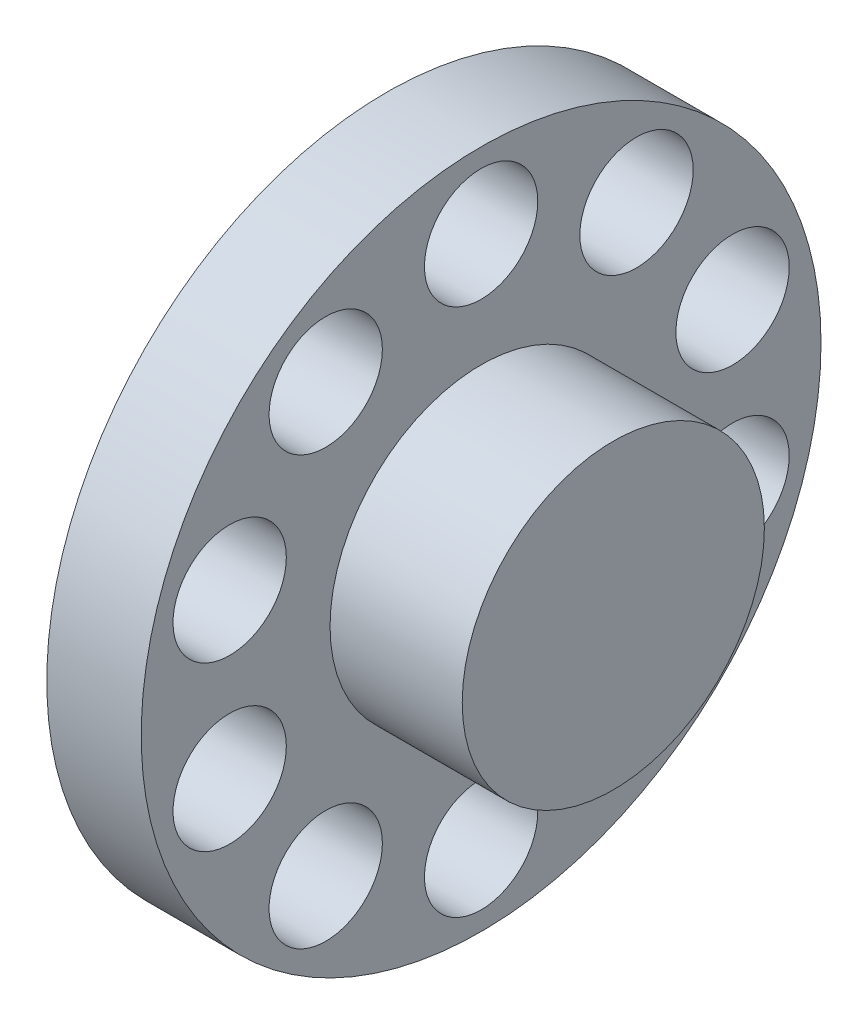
ISO-10303-21;
HEADER;
FILE_DESCRIPTION(('STEP AP214'),'2;1');
FILE_NAME('part.step','',(''),(''),'','','');
FILE_SCHEMA(('AUTOMOTIVE_DESIGN { 1 0 10303 214 1 1 1 1 }'));
ENDSEC;
DATA;
#1=APPLICATION_CONTEXT('core data for automotive mechanical design processes');
#2=APPLICATION_PROTOCOL_DEFINITION('international standard','automotive_design',2000,#1);
#3=PRODUCT_CONTEXT('',#1,'mechanical');
#4=PRODUCT('Part','Part','',(#3));
#5=PRODUCT_RELATED_PRODUCT_CATEGORY('part','',(#4));
#6=PRODUCT_DEFINITION_FORMATION('','',#4);
#7=PRODUCT_DEFINITION_CONTEXT('part definition',#1,'design');
#8=PRODUCT_DEFINITION('design','',#6,#7);
#9=PRODUCT_DEFINITION_SHAPE('','',#8);
#10=(LENGTH_UNIT() NAMED_UNIT(*) SI_UNIT(.MILLI.,.METRE.));
#11=(NAMED_UNIT(*) PLANE_ANGLE_UNIT() SI_UNIT($,.RADIAN.));
#12=(NAMED_UNIT(*) SI_UNIT($,.STERADIAN.) SOLID_ANGLE_UNIT());
#13=UNCERTAINTY_MEASURE_WITH_UNIT(LENGTH_MEASURE(1.E-05),#10,'distance_accuracy_value','');
#14=(GEOMETRIC_REPRESENTATION_CONTEXT(3) GLOBAL_UNCERTAINTY_ASSIGNED_CONTEXT((#13)) GLOBAL_UNIT_ASSIGNED_CONTEXT((#10,
#11,#12)) REPRESENTATION_CONTEXT('',''));
#15=CARTESIAN_POINT('',(0.,0.,0.));
#16=DIRECTION('',(0.,0.,1.));
#17=DIRECTION('',(1.,0.,0.));
#18=AXIS2_PLACEMENT_3D('',#15,#16,#17);
#19=CARTESIAN_POINT('',(0.,0.,0.));
#20=DIRECTION('',(-1.,0.,0.));
#21=DIRECTION('',(0.,0.,1.));
#22=AXIS2_PLACEMENT_3D('',#19,#20,#21);
#23=PLANE('',#22);
#24=CARTESIAN_POINT('',(0.,56.6311896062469,-41.1449676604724));
#25=DIRECTION('',(-1.,0.,0.));
#26=DIRECTION('',(0.,0.587785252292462,0.809016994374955));
#27=AXIS2_PLACEMENT_3D('',#24,#25,#26);
#28=CIRCLE('',#27,15.);
#29=CARTESIAN_POINT('',(0.,65.4479683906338,-29.0097127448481));
#30=VERTEX_POINT('',#29);
#31=EDGE_CURVE('E112',#30,#30,#28,.T.);
#32=ORIENTED_EDGE('',*,*,#31,.F.);
#33=EDGE_LOOP('',(#32));
#34=FACE_BOUND('',#33,.T.);
#35=CARTESIAN_POINT('',(0.,21.6311896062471,-66.5739561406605));
#36=DIRECTION('',(-1.,0.,0.));
#37=DIRECTION('',(0.,0.95105651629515,0.309016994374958));
#38=AXIS2_PLACEMENT_3D('',#35,#36,#37);
#39=CIRCLE('',#38,15.);
#40=CARTESIAN_POINT('',(0.,35.8970373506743,-61.9387012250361));
#41=VERTEX_POINT('',#40);
#42=EDGE_CURVE('E116',#41,#41,#39,.T.);
#43=ORIENTED_EDGE('',*,*,#42,.F.);
#44=EDGE_LOOP('',(#43));
#45=FACE_BOUND('',#44,.T.);
#46=CARTESIAN_POINT('',(0.,-21.6311896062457,-66.573956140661));
#47=DIRECTION('',(-1.,0.,0.));
#48=DIRECTION('',(0.,0.951056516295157,-0.309016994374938));
#49=AXIS2_PLACEMENT_3D('',#46,#47,#48);
#50=CIRCLE('',#49,15.);
#51=CARTESIAN_POINT('',(0.,-7.36534186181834,-71.209211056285));
#52=VERTEX_POINT('',#51);
#53=EDGE_CURVE('E120',#52,#52,#50,.T.);
#54=ORIENTED_EDGE('',*,*,#53,.F.);
#55=EDGE_LOOP('',(#54));
#56=FACE_BOUND('',#55,.T.);
#57=CARTESIAN_POINT('',(0.,-56.631189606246,-41.1449676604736));
#58=DIRECTION('',(-1.,0.,0.));
#59=DIRECTION('',(0.,0.58778525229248,-0.809016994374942));
#60=AXIS2_PLACEMENT_3D('',#57,#58,#59);
#61=CIRCLE('',#60,15.);
#62=CARTESIAN_POINT('',(0.,-47.8144108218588,-53.2802225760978));
#63=VERTEX_POINT('',#62);
#64=EDGE_CURVE('E124',#63,#63,#61,.T.);
#65=ORIENTED_EDGE('',*,*,#64,.F.);
#66=EDGE_LOOP('',(#65));
#67=FACE_BOUND('',#66,.T.);
#68=CARTESIAN_POINT('',(0.,-70.,0.));
#69=DIRECTION('',(-1.,0.,0.));
#70=DIRECTION('',(0.,0.,-1.));
#71=AXIS2_PLACEMENT_3D('',#68,#69,#70);
#72=CIRCLE('',#71,15.);
#73=CARTESIAN_POINT('',(0.,-70.,-15.));
#74=VERTEX_POINT('',#73);
#75=EDGE_CURVE('E128',#74,#74,#72,.T.);
#76=ORIENTED_EDGE('',*,*,#75,.F.);
#77=EDGE_LOOP('',(#76));
#78=FACE_BOUND('',#77,.T.);
#79=CARTESIAN_POINT('',(0.,-56.6311896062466,41.1449676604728));
#80=DIRECTION('',(-1.,0.,0.));
#81=DIRECTION('',(0.,-0.587785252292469,-0.809016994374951));
#82=AXIS2_PLACEMENT_3D('',#79,#80,#81);
#83=CIRCLE('',#82,15.);
#84=CARTESIAN_POINT('',(0.,-65.4479683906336,29.0097127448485));
#85=VERTEX_POINT('',#84);
#86=EDGE_CURVE('E132',#85,#85,#83,.T.);
#87=ORIENTED_EDGE('',*,*,#86,.F.);
#88=EDGE_LOOP('',(#87));
#89=FACE_BOUND('',#88,.T.);
#90=CARTESIAN_POINT('',(0.,-21.6311896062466,66.5739561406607));
#91=DIRECTION('',(-1.,0.,0.));
#92=DIRECTION('',(0.,-0.951056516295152,-0.309016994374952));
#93=AXIS2_PLACEMENT_3D('',#90,#91,#92);
#94=CIRCLE('',#93,15.);
#95=CARTESIAN_POINT('',(0.,-35.8970373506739,61.9387012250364));
#96=VERTEX_POINT('',#95);
#97=EDGE_CURVE('E136',#96,#96,#94,.T.);
#98=ORIENTED_EDGE('',*,*,#97,.F.);
#99=EDGE_LOOP('',(#98));
#100=FACE_BOUND('',#99,.T.);
#101=CARTESIAN_POINT('',(0.,21.6311896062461,66.5739561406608));
#102=DIRECTION('',(-1.,0.,0.));
#103=DIRECTION('',(0.,-0.951056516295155,0.309016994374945));
#104=AXIS2_PLACEMENT_3D('',#101,#102,#103);
#105=CIRCLE('',#104,15.);
#106=CARTESIAN_POINT('',(0.,7.36534186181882,71.209211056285));
#107=VERTEX_POINT('',#106);
#108=EDGE_CURVE('E140',#107,#107,#105,.T.);
#109=ORIENTED_EDGE('',*,*,#108,.F.);
#110=EDGE_LOOP('',(#109));
#111=FACE_BOUND('',#110,.T.);
#112=CARTESIAN_POINT('',(0.,56.6311896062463,41.1449676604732));
#113=DIRECTION('',(-1.,0.,0.));
#114=DIRECTION('',(0.,-0.587785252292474,0.809016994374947));
#115=AXIS2_PLACEMENT_3D('',#112,#113,#114);
#116=CIRCLE('',#115,15.);
#117=CARTESIAN_POINT('',(0.,47.8144108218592,53.2802225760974));
#118=VERTEX_POINT('',#117);
#119=EDGE_CURVE('E55',#118,#118,#116,.T.);
#120=ORIENTED_EDGE('',*,*,#119,.F.);
#121=EDGE_LOOP('',(#120));
#122=FACE_BOUND('',#121,.T.);
#123=CARTESIAN_POINT('',(0.,70.,0.));
#124=DIRECTION('',(-1.,0.,0.));
#125=DIRECTION('',(0.,0.,1.));
#126=AXIS2_PLACEMENT_3D('',#123,#124,#125);
#127=CIRCLE('',#126,15.);
#128=CARTESIAN_POINT('',(0.,70.,15.));
#129=VERTEX_POINT('',#128);
#130=EDGE_CURVE('E50',#129,#129,#127,.T.);
#131=ORIENTED_EDGE('',*,*,#130,.F.);
#132=EDGE_LOOP('',(#131));
#133=FACE_BOUND('',#132,.T.);
#134=CARTESIAN_POINT('',(0.,0.,0.));
#135=DIRECTION('',(1.,0.,0.));
#136=DIRECTION('',(0.,0.,-1.));
#137=AXIS2_PLACEMENT_3D('',#134,#135,#136);
#138=CIRCLE('',#137,90.);
#139=CARTESIAN_POINT('',(0.,0.,-90.));
#140=VERTEX_POINT('',#139);
#141=EDGE_CURVE('E10',#140,#140,#138,.T.);
#142=ORIENTED_EDGE('',*,*,#141,.F.);
#143=EDGE_LOOP('',(#142));
#144=FACE_BOUND('',#143,.T.);
#145=ADVANCED_FACE('F30',(#34,#45,#56,#67,#78,#89,#100,#111,#122,#133,#144),#23,.T.);
#146=CARTESIAN_POINT('',(0.,0.,0.));
#147=DIRECTION('',(1.,0.,0.));
#148=DIRECTION('',(0.,0.,-1.));
#149=AXIS2_PLACEMENT_3D('',#146,#147,#148);
#150=CYLINDRICAL_SURFACE('',#149,90.);
#151=ORIENTED_EDGE('',*,*,#141,.T.);
#152=EDGE_LOOP('',(#151));
#153=FACE_BOUND('',#152,.T.);
#154=CARTESIAN_POINT('',(25.,0.,0.));
#155=DIRECTION('',(1.,0.,0.));
#156=DIRECTION('',(0.,0.,-1.));
#157=AXIS2_PLACEMENT_3D('',#154,#155,#156);
#158=CIRCLE('',#157,90.);
#159=CARTESIAN_POINT('',(25.,0.,-90.));
#160=VERTEX_POINT('',#159);
#161=EDGE_CURVE('E37',#160,#160,#158,.T.);
#162=ORIENTED_EDGE('',*,*,#161,.F.);
#163=EDGE_LOOP('',(#162));
#164=FACE_BOUND('',#163,.T.);
#165=ADVANCED_FACE('F95',(#153,#164),#150,.T.);
#166=CARTESIAN_POINT('',(25.,90.,0.));
#167=DIRECTION('',(1.,0.,0.));
#168=DIRECTION('',(0.,0.,-1.));
#169=AXIS2_PLACEMENT_3D('',#166,#167,#168);
#170=PLANE('',#169);
#171=CARTESIAN_POINT('',(25.,56.6311896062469,-41.1449676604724));
#172=DIRECTION('',(1.,0.,0.));
#173=DIRECTION('',(0.,0.,-1.));
#174=AXIS2_PLACEMENT_3D('',#171,#172,#173);
#175=CIRCLE('',#174,15.);
#176=CARTESIAN_POINT('',(25.,56.6311896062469,-56.1449676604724));
#177=VERTEX_POINT('',#176);
#178=EDGE_CURVE('E33',#177,#177,#175,.T.);
#179=ORIENTED_EDGE('',*,*,#178,.F.);
#180=EDGE_LOOP('',(#179));
#181=FACE_BOUND('',#180,.T.);
#182=CARTESIAN_POINT('',(25.,21.6311896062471,-66.5739561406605));
#183=DIRECTION('',(1.,0.,0.));
#184=DIRECTION('',(0.,0.,-1.));
#185=AXIS2_PLACEMENT_3D('',#182,#183,#184);
#186=CIRCLE('',#185,15.);
#187=CARTESIAN_POINT('',(25.,21.6311896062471,-81.5739561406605));
#188=VERTEX_POINT('',#187);
#189=EDGE_CURVE('E72',#188,#188,#186,.T.);
#190=ORIENTED_EDGE('',*,*,#189,.F.);
#191=EDGE_LOOP('',(#190));
#192=FACE_BOUND('',#191,.T.);
#193=CARTESIAN_POINT('',(25.,-21.6311896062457,-66.573956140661));
#194=DIRECTION('',(1.,0.,0.));
#195=DIRECTION('',(0.,0.,-1.));
#196=AXIS2_PLACEMENT_3D('',#193,#194,#195);
#197=CIRCLE('',#196,15.);
#198=CARTESIAN_POINT('',(25.,-21.6311896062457,-81.573956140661));
#199=VERTEX_POINT('',#198);
#200=EDGE_CURVE('E70',#199,#199,#197,.T.);
#201=ORIENTED_EDGE('',*,*,#200,.F.);
#202=EDGE_LOOP('',(#201));
#203=FACE_BOUND('',#202,.T.);
#204=CARTESIAN_POINT('',(25.,-56.631189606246,-41.1449676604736));
#205=DIRECTION('',(1.,0.,0.));
#206=DIRECTION('',(0.,0.,-1.));
#207=AXIS2_PLACEMENT_3D('',#204,#205,#206);
#208=CIRCLE('',#207,15.);
#209=CARTESIAN_POINT('',(25.,-56.631189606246,-56.1449676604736));
#210=VERTEX_POINT('',#209);
#211=EDGE_CURVE('E67',#210,#210,#208,.T.);
#212=ORIENTED_EDGE('',*,*,#211,.F.);
#213=EDGE_LOOP('',(#212));
#214=FACE_BOUND('',#213,.T.);
#215=CARTESIAN_POINT('',(25.,-70.,0.));
#216=DIRECTION('',(1.,0.,0.));
#217=DIRECTION('',(0.,0.,-1.));
#218=AXIS2_PLACEMENT_3D('',#215,#216,#217);
#219=CIRCLE('',#218,15.);
#220=CARTESIAN_POINT('',(25.,-70.,-15.));
#221=VERTEX_POINT('',#220);
#222=EDGE_CURVE('E64',#221,#221,#219,.T.);
#223=ORIENTED_EDGE('',*,*,#222,.F.);
#224=EDGE_LOOP('',(#223));
#225=FACE_BOUND('',#224,.T.);
#226=CARTESIAN_POINT('',(25.,-56.6311896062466,41.1449676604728));
#227=DIRECTION('',(1.,0.,0.));
#228=DIRECTION('',(0.,0.,-1.));
#229=AXIS2_PLACEMENT_3D('',#226,#227,#228);
#230=CIRCLE('',#229,15.);
#231=CARTESIAN_POINT('',(25.,-56.6311896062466,26.1449676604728));
#232=VERTEX_POINT('',#231);
#233=EDGE_CURVE('E61',#232,#232,#230,.T.);
#234=ORIENTED_EDGE('',*,*,#233,.F.);
#235=EDGE_LOOP('',(#234));
#236=FACE_BOUND('',#235,.T.);
#237=CARTESIAN_POINT('',(25.,-21.6311896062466,66.5739561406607));
#238=DIRECTION('',(1.,0.,0.));
#239=DIRECTION('',(0.,0.,-1.));
#240=AXIS2_PLACEMENT_3D('',#237,#238,#239);
#241=CIRCLE('',#240,15.);
#242=CARTESIAN_POINT('',(25.,-21.6311896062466,51.5739561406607));
#243=VERTEX_POINT('',#242);
#244=EDGE_CURVE('E58',#243,#243,#241,.T.);
#245=ORIENTED_EDGE('',*,*,#244,.F.);
#246=EDGE_LOOP('',(#245));
#247=FACE_BOUND('',#246,.T.);
#248=CARTESIAN_POINT('',(25.,21.6311896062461,66.5739561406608));
#249=DIRECTION('',(1.,0.,0.));
#250=DIRECTION('',(0.,0.,-1.));
#251=AXIS2_PLACEMENT_3D('',#248,#249,#250);
#252=CIRCLE('',#251,15.);
#253=CARTESIAN_POINT('',(25.,21.6311896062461,51.5739561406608));
#254=VERTEX_POINT('',#253);
#255=EDGE_CURVE('E54',#254,#254,#252,.T.);
#256=ORIENTED_EDGE('',*,*,#255,.F.);
#257=EDGE_LOOP('',(#256));
#258=FACE_BOUND('',#257,.T.);
#259=CARTESIAN_POINT('',(25.,56.6311896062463,41.1449676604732));
#260=DIRECTION('',(1.,0.,0.));
#261=DIRECTION('',(0.,0.,-1.));
#262=AXIS2_PLACEMENT_3D('',#259,#260,#261);
#263=CIRCLE('',#262,15.);
#264=CARTESIAN_POINT('',(25.,56.6311896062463,26.1449676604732));
#265=VERTEX_POINT('',#264);
#266=EDGE_CURVE('E51',#265,#265,#263,.T.);
#267=ORIENTED_EDGE('',*,*,#266,.F.);
#268=EDGE_LOOP('',(#267));
#269=FACE_BOUND('',#268,.T.);
#270=CARTESIAN_POINT('',(25.,70.,0.));
#271=DIRECTION('',(1.,0.,0.));
#272=DIRECTION('',(0.,0.,-1.));
#273=AXIS2_PLACEMENT_3D('',#270,#271,#272);
#274=CIRCLE('',#273,15.);
#275=CARTESIAN_POINT('',(25.,70.,-15.));
#276=VERTEX_POINT('',#275);
#277=EDGE_CURVE('E46',#276,#276,#274,.T.);
#278=ORIENTED_EDGE('',*,*,#277,.F.);
#279=EDGE_LOOP('',(#278));
#280=FACE_BOUND('',#279,.T.);
#281=ORIENTED_EDGE('',*,*,#161,.T.);
#282=EDGE_LOOP('',(#281));
#283=FACE_BOUND('',#282,.T.);
#284=CARTESIAN_POINT('',(25.,0.,0.));
#285=DIRECTION('',(1.,0.,0.));
#286=DIRECTION('',(0.,0.,-1.));
#287=AXIS2_PLACEMENT_3D('',#284,#285,#286);
#288=CIRCLE('',#287,40.);
#289=CARTESIAN_POINT('',(25.,0.,-40.));
#290=VERTEX_POINT('',#289);
#291=EDGE_CURVE('E42',#290,#290,#288,.T.);
#292=ORIENTED_EDGE('',*,*,#291,.F.);
#293=EDGE_LOOP('',(#292));
#294=FACE_BOUND('',#293,.T.);
#295=ADVANCED_FACE('F93',(#181,#192,#203,#214,#225,#236,#247,#258,#269,#280,#283,#294),#170,.T.);
#296=CARTESIAN_POINT('',(0.,0.,0.));
#297=DIRECTION('',(1.,0.,0.));
#298=DIRECTION('',(0.,0.,-1.));
#299=AXIS2_PLACEMENT_3D('',#296,#297,#298);
#300=CYLINDRICAL_SURFACE('',#299,40.);
#301=ORIENTED_EDGE('',*,*,#291,.T.);
#302=EDGE_LOOP('',(#301));
#303=FACE_BOUND('',#302,.T.);
#304=CARTESIAN_POINT('',(60.,0.,0.));
#305=DIRECTION('',(1.,0.,0.));
#306=DIRECTION('',(0.,0.,-1.));
#307=AXIS2_PLACEMENT_3D('',#304,#305,#306);
#308=CIRCLE('',#307,40.);
#309=CARTESIAN_POINT('',(60.,0.,-40.));
#310=VERTEX_POINT('',#309);
#311=EDGE_CURVE('E49',#310,#310,#308,.T.);
#312=ORIENTED_EDGE('',*,*,#311,.F.);
#313=EDGE_LOOP('',(#312));
#314=FACE_BOUND('',#313,.T.);
#315=ADVANCED_FACE('F90',(#303,#314),#300,.T.);
#316=CARTESIAN_POINT('',(60.,40.,0.));
#317=DIRECTION('',(1.,0.,0.));
#318=DIRECTION('',(0.,0.,-1.));
#319=AXIS2_PLACEMENT_3D('',#316,#317,#318);
#320=PLANE('',#319);
#321=ORIENTED_EDGE('',*,*,#311,.T.);
#322=EDGE_LOOP('',(#321));
#323=FACE_BOUND('',#322,.T.);
#324=ADVANCED_FACE('F102',(#323),#320,.T.);
#325=CARTESIAN_POINT('',(60.,70.,0.));
#326=DIRECTION('',(-1.,0.,0.));
#327=DIRECTION('',(0.,0.,1.));
#328=AXIS2_PLACEMENT_3D('',#325,#326,#327);
#329=CYLINDRICAL_SURFACE('',#328,15.);
#330=ORIENTED_EDGE('',*,*,#277,.T.);
#331=EDGE_LOOP('',(#330));
#332=FACE_BOUND('',#331,.T.);
#333=ORIENTED_EDGE('',*,*,#130,.T.);
#334=EDGE_LOOP('',(#333));
#335=FACE_BOUND('',#334,.T.);
#336=ADVANCED_FACE('F170',(#332,#335),#329,.F.);
#337=CARTESIAN_POINT('',(60.,56.6311896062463,41.1449676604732));
#338=DIRECTION('',(-1.,0.,0.));
#339=DIRECTION('',(0.,0.,1.));
#340=AXIS2_PLACEMENT_3D('',#337,#338,#339);
#341=CYLINDRICAL_SURFACE('',#340,15.);
#342=ORIENTED_EDGE('',*,*,#266,.T.);
#343=EDGE_LOOP('',(#342));
#344=FACE_BOUND('',#343,.T.);
#345=ORIENTED_EDGE('',*,*,#119,.T.);
#346=EDGE_LOOP('',(#345));
#347=FACE_BOUND('',#346,.T.);
#348=ADVANCED_FACE('F166',(#344,#347),#341,.F.);
#349=CARTESIAN_POINT('',(60.,21.6311896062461,66.5739561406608));
#350=DIRECTION('',(-1.,0.,0.));
#351=DIRECTION('',(0.,0.,1.));
#352=AXIS2_PLACEMENT_3D('',#349,#350,#351);
#353=CYLINDRICAL_SURFACE('',#352,15.);
#354=ORIENTED_EDGE('',*,*,#255,.T.);
#355=EDGE_LOOP('',(#354));
#356=FACE_BOUND('',#355,.T.);
#357=ORIENTED_EDGE('',*,*,#108,.T.);
#358=EDGE_LOOP('',(#357));
#359=FACE_BOUND('',#358,.T.);
#360=ADVANCED_FACE('F169',(#356,#359),#353,.F.);
#361=CARTESIAN_POINT('',(60.,-21.6311896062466,66.5739561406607));
#362=DIRECTION('',(-1.,0.,0.));
#363=DIRECTION('',(0.,0.,1.));
#364=AXIS2_PLACEMENT_3D('',#361,#362,#363);
#365=CYLINDRICAL_SURFACE('',#364,15.);
#366=ORIENTED_EDGE('',*,*,#244,.T.);
#367=EDGE_LOOP('',(#366));
#368=FACE_BOUND('',#367,.T.);
#369=ORIENTED_EDGE('',*,*,#97,.T.);
#370=EDGE_LOOP('',(#369));
#371=FACE_BOUND('',#370,.T.);
#372=ADVANCED_FACE('F196',(#368,#371),#365,.F.);
#373=CARTESIAN_POINT('',(60.,-56.6311896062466,41.1449676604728));
#374=DIRECTION('',(-1.,0.,0.));
#375=DIRECTION('',(0.,0.,1.));
#376=AXIS2_PLACEMENT_3D('',#373,#374,#375);
#377=CYLINDRICAL_SURFACE('',#376,15.);
#378=ORIENTED_EDGE('',*,*,#233,.T.);
#379=EDGE_LOOP('',(#378));
#380=FACE_BOUND('',#379,.T.);
#381=ORIENTED_EDGE('',*,*,#86,.T.);
#382=EDGE_LOOP('',(#381));
#383=FACE_BOUND('',#382,.T.);
#384=ADVANCED_FACE('F204',(#380,#383),#377,.F.);
#385=CARTESIAN_POINT('',(60.,-70.,0.));
#386=DIRECTION('',(-1.,0.,0.));
#387=DIRECTION('',(0.,0.,1.));
#388=AXIS2_PLACEMENT_3D('',#385,#386,#387);
#389=CYLINDRICAL_SURFACE('',#388,15.);
#390=ORIENTED_EDGE('',*,*,#222,.T.);
#391=EDGE_LOOP('',(#390));
#392=FACE_BOUND('',#391,.T.);
#393=ORIENTED_EDGE('',*,*,#75,.T.);
#394=EDGE_LOOP('',(#393));
#395=FACE_BOUND('',#394,.T.);
#396=ADVANCED_FACE('F212',(#392,#395),#389,.F.);
#397=CARTESIAN_POINT('',(60.,-56.631189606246,-41.1449676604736));
#398=DIRECTION('',(-1.,0.,0.));
#399=DIRECTION('',(0.,0.,1.));
#400=AXIS2_PLACEMENT_3D('',#397,#398,#399);
#401=CYLINDRICAL_SURFACE('',#400,15.);
#402=ORIENTED_EDGE('',*,*,#211,.T.);
#403=EDGE_LOOP('',(#402));
#404=FACE_BOUND('',#403,.T.);
#405=ORIENTED_EDGE('',*,*,#64,.T.);
#406=EDGE_LOOP('',(#405));
#407=FACE_BOUND('',#406,.T.);
#408=ADVANCED_FACE('F220',(#404,#407),#401,.F.);
#409=CARTESIAN_POINT('',(60.,-21.6311896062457,-66.573956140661));
#410=DIRECTION('',(-1.,0.,0.));
#411=DIRECTION('',(0.,0.,1.));
#412=AXIS2_PLACEMENT_3D('',#409,#410,#411);
#413=CYLINDRICAL_SURFACE('',#412,15.);
#414=ORIENTED_EDGE('',*,*,#200,.T.);
#415=EDGE_LOOP('',(#414));
#416=FACE_BOUND('',#415,.T.);
#417=ORIENTED_EDGE('',*,*,#53,.T.);
#418=EDGE_LOOP('',(#417));
#419=FACE_BOUND('',#418,.T.);
#420=ADVANCED_FACE('F162',(#416,#419),#413,.F.);
#421=CARTESIAN_POINT('',(60.,21.6311896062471,-66.5739561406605));
#422=DIRECTION('',(-1.,0.,0.));
#423=DIRECTION('',(0.,0.,1.));
#424=AXIS2_PLACEMENT_3D('',#421,#422,#423);
#425=CYLINDRICAL_SURFACE('',#424,15.);
#426=ORIENTED_EDGE('',*,*,#189,.T.);
#427=EDGE_LOOP('',(#426));
#428=FACE_BOUND('',#427,.T.);
#429=ORIENTED_EDGE('',*,*,#42,.T.);
#430=EDGE_LOOP('',(#429));
#431=FACE_BOUND('',#430,.T.);
#432=ADVANCED_FACE('F157',(#428,#431),#425,.F.);
#433=CARTESIAN_POINT('',(60.,56.6311896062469,-41.1449676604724));
#434=DIRECTION('',(-1.,0.,0.));
#435=DIRECTION('',(0.,0.,1.));
#436=AXIS2_PLACEMENT_3D('',#433,#434,#435);
#437=CYLINDRICAL_SURFACE('',#436,15.);
#438=ORIENTED_EDGE('',*,*,#178,.T.);
#439=EDGE_LOOP('',(#438));
#440=FACE_BOUND('',#439,.T.);
#441=ORIENTED_EDGE('',*,*,#31,.T.);
#442=EDGE_LOOP('',(#441));
#443=FACE_BOUND('',#442,.T.);
#444=ADVANCED_FACE('F155',(#440,#443),#437,.F.);
#445=CLOSED_SHELL('',(#145,#165,#295,#315,#324,#336,#348,#360,#372,#384,#396,#408,#420,#432,#444));
#446=MANIFOLD_SOLID_BREP('B2',#445);
#447=ADVANCED_BREP_SHAPE_REPRESENTATION('',(#18,#446),#14);
#448=SHAPE_DEFINITION_REPRESENTATION(#9,#447);
ENDSEC;
END-ISO-10303-21;
